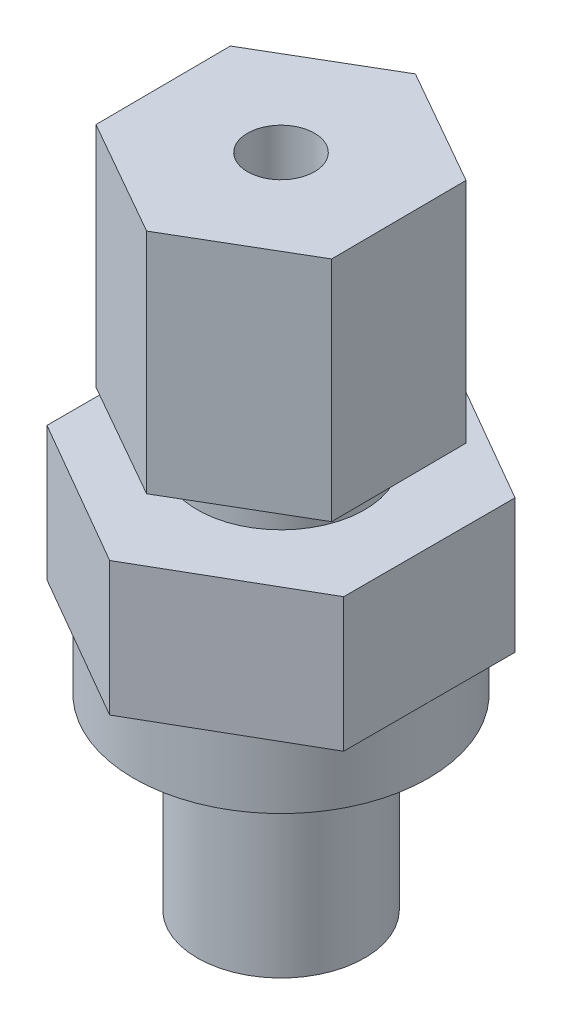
from build123d import *

# Parameters (mm, degrees)
SKETCH1_R               = 3.96875
F_5_16_24_THREADS_DEPTH = 8.89
SKETCH2_R               = 6.985
ORING_BASE_DEPTH        = 3.175
F_9_16_HEX_DEPTH        = 6.35
SKETCH4_R               = 3.96875
TUBE_DEPTH              = 9.525
EXTRUDE1_DEPTH          = 3.175
EXTRUDE1_DEPTH_BACK     = 7.62
SKETCH6_R               = 1.5875
CUT_EXTRUDE1_DEPTH      = 12.7
SKETCH7_R               = 1.1684
CUT_EXTRUDE2_DEPTH      = 33.920448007


with BuildPart() as part:
    # Sketch1 → 5_16-24_threads (new body)
    with BuildSketch(Plane(origin=(0, 0, 0), x_dir=(1, 0, 0), z_dir=(0, 1, 0))):
        with Locations(Location((0, 0, 0), (0, 0, 270))):
            Circle(SKETCH1_R)
    extrude(amount=F_5_16_24_THREADS_DEPTH)

    # Sketch2 → oring_base (add)
    with BuildSketch(Plane(origin=(0, 8.89, 0), x_dir=(1, 0, 0), z_dir=(0, 1, 0))):
        with Locations(Location((0, 0, 0), (0, 0, 270))):
            Circle(SKETCH2_R)
    extrude(amount=ORING_BASE_DEPTH)

    # Sketch3 → 9_16_hex (add)
    with BuildSketch(Plane(origin=(0, 12.065, 0), x_dir=(1, 0, 0), z_dir=(0, 1, 0))):
        Polygon((7.039054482, 4.064), (0, 8.128), (-7.039054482, 4.064), (-7.039054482, -4.064), (0, -8.128), (7.039054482, -4.064), align=None)
    extrude(amount=F_9_16_HEX_DEPTH)

    # Sketch4 → tube (add)
    with BuildSketch(Plane(origin=(0, 18.415, 0), x_dir=(1, 0, 0), z_dir=(0, 1, 0))):
        with Locations(Location((0, 0, 0), (0, 0, 270))):
            Circle(SKETCH4_R)
    extrude(amount=TUBE_DEPTH)

    # Sketch5 → Extrude1 (add, two sides: drawn at the far end of the back side and taken through both)
    with BuildSketch(Plane(origin=(0, 27.94, 0), x_dir=(1, 0, 0), z_dir=(0, 1, 0)).offset(-EXTRUDE1_DEPTH_BACK)):
        Polygon((5.576358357, -3.172818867), (5.535920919, 3.242858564), (-0.040437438, 6.415677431), (-5.576358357, 3.172818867), (-5.535920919, -3.242858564), (0.040437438, -6.415677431), align=None)
    extrude(amount=EXTRUDE1_DEPTH + EXTRUDE1_DEPTH_BACK)

    # Sketch6 → Cut-Extrude1 (cut)
    with BuildSketch(Plane(origin=(0, 31.115, 0), x_dir=(1, 0, 0), z_dir=(0, 1, 0))):
        with Locations(Location((0, 0, 0), (0, 0, 270))):
            Circle(SKETCH6_R)
    extrude(amount=-CUT_EXTRUDE1_DEPTH, mode=Mode.SUBTRACT)

    # Sketch7 → Cut-Extrude2 (cut, through all)
    with BuildSketch(Plane.XZ):
        with Locations(Location((0, 0, 0), (0, 0, 270))):
            Circle(SKETCH7_R)
    extrude(amount=-CUT_EXTRUDE2_DEPTH, mode=Mode.SUBTRACT)


solid = part.part
